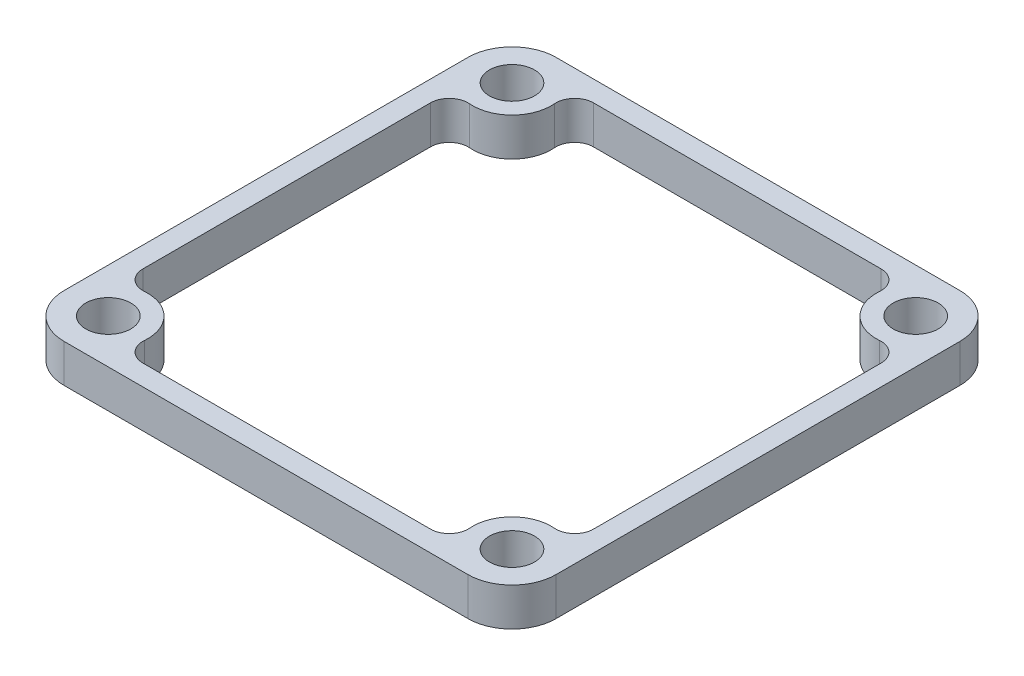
ISO-10303-21;
HEADER;
FILE_DESCRIPTION(('STEP AP214'),'2;1');
FILE_NAME('part.step','',(''),(''),'','','');
FILE_SCHEMA(('AUTOMOTIVE_DESIGN { 1 0 10303 214 1 1 1 1 }'));
ENDSEC;
DATA;
#1=APPLICATION_CONTEXT('core data for automotive mechanical design processes');
#2=APPLICATION_PROTOCOL_DEFINITION('international standard','automotive_design',2000,#1);
#3=PRODUCT_CONTEXT('',#1,'mechanical');
#4=PRODUCT('Part','Part','',(#3));
#5=PRODUCT_RELATED_PRODUCT_CATEGORY('part','',(#4));
#6=PRODUCT_DEFINITION_FORMATION('','',#4);
#7=PRODUCT_DEFINITION_CONTEXT('part definition',#1,'design');
#8=PRODUCT_DEFINITION('design','',#6,#7);
#9=PRODUCT_DEFINITION_SHAPE('','',#8);
#10=(LENGTH_UNIT() NAMED_UNIT(*) SI_UNIT(.MILLI.,.METRE.));
#11=(NAMED_UNIT(*) PLANE_ANGLE_UNIT() SI_UNIT($,.RADIAN.));
#12=(NAMED_UNIT(*) SI_UNIT($,.STERADIAN.) SOLID_ANGLE_UNIT());
#13=UNCERTAINTY_MEASURE_WITH_UNIT(LENGTH_MEASURE(1.E-05),#10,'distance_accuracy_value','');
#14=(GEOMETRIC_REPRESENTATION_CONTEXT(3) GLOBAL_UNCERTAINTY_ASSIGNED_CONTEXT((#13)) GLOBAL_UNIT_ASSIGNED_CONTEXT((#10,
#11,#12)) REPRESENTATION_CONTEXT('',''));
#15=CARTESIAN_POINT('',(0.,0.,0.));
#16=DIRECTION('',(0.,0.,1.));
#17=DIRECTION('',(1.,0.,0.));
#18=AXIS2_PLACEMENT_3D('',#15,#16,#17);
#19=CARTESIAN_POINT('',(21.75,2.032,-18.4100970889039));
#20=DIRECTION('',(0.,-1.,0.));
#21=DIRECTION('',(0.,0.,-1.));
#22=AXIS2_PLACEMENT_3D('',#19,#20,#21);
#23=CYLINDRICAL_SURFACE('',#22,1.);
#24=DIRECTION('',(0.,1.,0.));
#25=VECTOR('',#24,1.);
#26=CARTESIAN_POINT('',(22.75,2.032,-18.4100970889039));
#27=LINE('',#26,#25);
#28=CARTESIAN_POINT('',(22.75,2.032,-18.4100970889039));
#29=VERTEX_POINT('',#28);
#30=CARTESIAN_POINT('',(22.75,0.,-18.4100970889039));
#31=VERTEX_POINT('',#30);
#32=EDGE_CURVE('E423',#29,#31,#27,.F.);
#33=ORIENTED_EDGE('',*,*,#32,.F.);
#34=CARTESIAN_POINT('',(21.75,2.032,-18.4100970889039));
#35=DIRECTION('',(0.,1.,0.));
#36=DIRECTION('',(0.,0.,1.));
#37=AXIS2_PLACEMENT_3D('',#34,#35,#36);
#38=CIRCLE('',#37,1.);
#39=CARTESIAN_POINT('',(21.6693548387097,2.032,-19.406839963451));
#40=VERTEX_POINT('',#39);
#41=EDGE_CURVE('E53',#29,#40,#38,.T.);
#42=ORIENTED_EDGE('',*,*,#41,.T.);
#43=DIRECTION('',(0.,-1.,0.));
#44=VECTOR('',#43,1.);
#45=CARTESIAN_POINT('',(21.6693548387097,2.032,-19.406839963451));
#46=LINE('',#45,#44);
#47=CARTESIAN_POINT('',(21.6693548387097,0.,-19.406839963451));
#48=VERTEX_POINT('',#47);
#49=EDGE_CURVE('E427',#48,#40,#46,.F.);
#50=ORIENTED_EDGE('',*,*,#49,.F.);
#51=CARTESIAN_POINT('',(21.75,0.,-18.4100970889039));
#52=DIRECTION('',(0.,1.,0.));
#53=DIRECTION('',(0.,0.,1.));
#54=AXIS2_PLACEMENT_3D('',#51,#52,#53);
#55=CIRCLE('',#54,1.);
#56=EDGE_CURVE('E11',#48,#31,#55,.F.);
#57=ORIENTED_EDGE('',*,*,#56,.T.);
#58=EDGE_LOOP('',(#33,#42,#50,#57));
#59=FACE_BOUND('',#58,.T.);
#60=ADVANCED_FACE('F45',(#59),#23,.F.);
#61=CARTESIAN_POINT('',(21.75,2.032,-3.08990291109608));
#62=DIRECTION('',(0.,-1.,0.));
#63=DIRECTION('',(0.,0.,-1.));
#64=AXIS2_PLACEMENT_3D('',#61,#62,#63);
#65=CYLINDRICAL_SURFACE('',#64,1.);
#66=DIRECTION('',(0.,-1.,0.));
#67=VECTOR('',#66,1.);
#68=CARTESIAN_POINT('',(21.6693548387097,2.032,-2.09316003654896));
#69=LINE('',#68,#67);
#70=CARTESIAN_POINT('',(21.6693548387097,2.032,-2.09316003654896));
#71=VERTEX_POINT('',#70);
#72=CARTESIAN_POINT('',(21.6693548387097,0.,-2.09316003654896));
#73=VERTEX_POINT('',#72);
#74=EDGE_CURVE('E409',#71,#73,#69,.T.);
#75=ORIENTED_EDGE('',*,*,#74,.F.);
#76=CARTESIAN_POINT('',(21.75,2.032,-3.08990291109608));
#77=DIRECTION('',(0.,1.,0.));
#78=DIRECTION('',(0.,0.,1.));
#79=AXIS2_PLACEMENT_3D('',#76,#77,#78);
#80=CIRCLE('',#79,1.);
#81=CARTESIAN_POINT('',(22.75,2.032,-3.08990291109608));
#82=VERTEX_POINT('',#81);
#83=EDGE_CURVE('E417',#71,#82,#80,.T.);
#84=ORIENTED_EDGE('',*,*,#83,.T.);
#85=DIRECTION('',(0.,1.,0.));
#86=VECTOR('',#85,1.);
#87=CARTESIAN_POINT('',(22.75,2.032,-3.08990291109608));
#88=LINE('',#87,#86);
#89=CARTESIAN_POINT('',(22.75,0.,-3.08990291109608));
#90=VERTEX_POINT('',#89);
#91=EDGE_CURVE('E413',#90,#82,#88,.T.);
#92=ORIENTED_EDGE('',*,*,#91,.F.);
#93=CARTESIAN_POINT('',(21.75,0.,-3.08990291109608));
#94=DIRECTION('',(0.,1.,0.));
#95=DIRECTION('',(0.,0.,1.));
#96=AXIS2_PLACEMENT_3D('',#93,#94,#95);
#97=CIRCLE('',#96,1.);
#98=EDGE_CURVE('E420',#90,#73,#97,.F.);
#99=ORIENTED_EDGE('',*,*,#98,.T.);
#100=EDGE_LOOP('',(#75,#84,#92,#99));
#101=FACE_BOUND('',#100,.T.);
#102=ADVANCED_FACE('F533',(#101),#65,.F.);
#103=CARTESIAN_POINT('',(18.4100970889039,2.032,0.250000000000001));
#104=DIRECTION('',(0.,-1.,0.));
#105=DIRECTION('',(0.,0.,-1.));
#106=AXIS2_PLACEMENT_3D('',#103,#104,#105);
#107=CYLINDRICAL_SURFACE('',#106,1.);
#108=DIRECTION('',(0.,1.,0.));
#109=VECTOR('',#108,1.);
#110=CARTESIAN_POINT('',(18.4100970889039,2.032,1.25));
#111=LINE('',#110,#109);
#112=CARTESIAN_POINT('',(18.4100970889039,2.032,1.25));
#113=VERTEX_POINT('',#112);
#114=CARTESIAN_POINT('',(18.4100970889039,0.,1.25));
#115=VERTEX_POINT('',#114);
#116=EDGE_CURVE('E394',#113,#115,#111,.F.);
#117=ORIENTED_EDGE('',*,*,#116,.F.);
#118=CARTESIAN_POINT('',(18.4100970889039,2.032,0.250000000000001));
#119=DIRECTION('',(0.,1.,0.));
#120=DIRECTION('',(0.,0.,1.));
#121=AXIS2_PLACEMENT_3D('',#118,#119,#120);
#122=CIRCLE('',#121,1.);
#123=CARTESIAN_POINT('',(19.406839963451,2.032,0.169354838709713));
#124=VERTEX_POINT('',#123);
#125=EDGE_CURVE('E402',#113,#124,#122,.T.);
#126=ORIENTED_EDGE('',*,*,#125,.T.);
#127=DIRECTION('',(0.,-1.,0.));
#128=VECTOR('',#127,1.);
#129=CARTESIAN_POINT('',(19.406839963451,2.032,0.169354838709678));
#130=LINE('',#129,#128);
#131=CARTESIAN_POINT('',(19.406839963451,0.,0.169354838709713));
#132=VERTEX_POINT('',#131);
#133=EDGE_CURVE('E398',#132,#124,#130,.F.);
#134=ORIENTED_EDGE('',*,*,#133,.F.);
#135=CARTESIAN_POINT('',(18.4100970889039,0.,0.250000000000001));
#136=DIRECTION('',(0.,1.,0.));
#137=DIRECTION('',(0.,0.,1.));
#138=AXIS2_PLACEMENT_3D('',#135,#136,#137);
#139=CIRCLE('',#138,1.);
#140=EDGE_CURVE('E406',#132,#115,#139,.F.);
#141=ORIENTED_EDGE('',*,*,#140,.T.);
#142=EDGE_LOOP('',(#117,#126,#134,#141));
#143=FACE_BOUND('',#142,.T.);
#144=ADVANCED_FACE('F539',(#143),#107,.F.);
#145=CARTESIAN_POINT('',(3.08990291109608,2.032,0.250000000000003));
#146=DIRECTION('',(0.,-1.,0.));
#147=DIRECTION('',(0.,0.,-1.));
#148=AXIS2_PLACEMENT_3D('',#145,#146,#147);
#149=CYLINDRICAL_SURFACE('',#148,1.);
#150=DIRECTION('',(0.,-1.,0.));
#151=VECTOR('',#150,1.);
#152=CARTESIAN_POINT('',(2.09316003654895,2.032,0.169354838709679));
#153=LINE('',#152,#151);
#154=CARTESIAN_POINT('',(2.09316003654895,2.032,0.16935483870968));
#155=VERTEX_POINT('',#154);
#156=CARTESIAN_POINT('',(2.09316003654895,0.,0.16935483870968));
#157=VERTEX_POINT('',#156);
#158=EDGE_CURVE('E380',#155,#157,#153,.T.);
#159=ORIENTED_EDGE('',*,*,#158,.F.);
#160=CARTESIAN_POINT('',(3.08990291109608,2.032,0.250000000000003));
#161=DIRECTION('',(0.,1.,0.));
#162=DIRECTION('',(0.,0.,1.));
#163=AXIS2_PLACEMENT_3D('',#160,#161,#162);
#164=CIRCLE('',#163,1.);
#165=CARTESIAN_POINT('',(3.08990291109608,2.032,1.25));
#166=VERTEX_POINT('',#165);
#167=EDGE_CURVE('E388',#155,#166,#164,.T.);
#168=ORIENTED_EDGE('',*,*,#167,.T.);
#169=DIRECTION('',(0.,1.,0.));
#170=VECTOR('',#169,1.);
#171=CARTESIAN_POINT('',(3.08990291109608,2.032,1.25));
#172=LINE('',#171,#170);
#173=CARTESIAN_POINT('',(3.08990291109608,0.,1.25));
#174=VERTEX_POINT('',#173);
#175=EDGE_CURVE('E384',#174,#166,#172,.T.);
#176=ORIENTED_EDGE('',*,*,#175,.F.);
#177=CARTESIAN_POINT('',(3.08990291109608,0.,0.250000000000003));
#178=DIRECTION('',(0.,1.,0.));
#179=DIRECTION('',(0.,0.,1.));
#180=AXIS2_PLACEMENT_3D('',#177,#178,#179);
#181=CIRCLE('',#180,1.);
#182=EDGE_CURVE('E391',#174,#157,#181,.F.);
#183=ORIENTED_EDGE('',*,*,#182,.T.);
#184=EDGE_LOOP('',(#159,#168,#176,#183));
#185=FACE_BOUND('',#184,.T.);
#186=ADVANCED_FACE('F585',(#185),#149,.F.);
#187=CARTESIAN_POINT('',(-0.25,2.032,-3.08990291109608));
#188=DIRECTION('',(0.,-1.,0.));
#189=DIRECTION('',(0.,0.,-1.));
#190=AXIS2_PLACEMENT_3D('',#187,#188,#189);
#191=CYLINDRICAL_SURFACE('',#190,1.);
#192=DIRECTION('',(0.,1.,0.));
#193=VECTOR('',#192,1.);
#194=CARTESIAN_POINT('',(-1.25,2.032,-3.08990291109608));
#195=LINE('',#194,#193);
#196=CARTESIAN_POINT('',(-1.25,2.032,-3.08990291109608));
#197=VERTEX_POINT('',#196);
#198=CARTESIAN_POINT('',(-1.25,0.,-3.08990291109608));
#199=VERTEX_POINT('',#198);
#200=EDGE_CURVE('E365',#197,#199,#195,.F.);
#201=ORIENTED_EDGE('',*,*,#200,.F.);
#202=CARTESIAN_POINT('',(-0.25,2.032,-3.08990291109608));
#203=DIRECTION('',(0.,1.,0.));
#204=DIRECTION('',(0.,0.,1.));
#205=AXIS2_PLACEMENT_3D('',#202,#203,#204);
#206=CIRCLE('',#205,1.);
#207=CARTESIAN_POINT('',(-0.169354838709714,2.032,-2.09316003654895));
#208=VERTEX_POINT('',#207);
#209=EDGE_CURVE('E373',#197,#208,#206,.T.);
#210=ORIENTED_EDGE('',*,*,#209,.T.);
#211=DIRECTION('',(0.,-1.,0.));
#212=VECTOR('',#211,1.);
#213=CARTESIAN_POINT('',(-0.169354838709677,2.032,-2.09316003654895));
#214=LINE('',#213,#212);
#215=CARTESIAN_POINT('',(-0.169354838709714,0.,-2.09316003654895));
#216=VERTEX_POINT('',#215);
#217=EDGE_CURVE('E369',#216,#208,#214,.F.);
#218=ORIENTED_EDGE('',*,*,#217,.F.);
#219=CARTESIAN_POINT('',(-0.25,0.,-3.08990291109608));
#220=DIRECTION('',(0.,1.,0.));
#221=DIRECTION('',(0.,0.,1.));
#222=AXIS2_PLACEMENT_3D('',#219,#220,#221);
#223=CIRCLE('',#222,1.);
#224=EDGE_CURVE('E377',#216,#199,#223,.F.);
#225=ORIENTED_EDGE('',*,*,#224,.T.);
#226=EDGE_LOOP('',(#201,#210,#218,#225));
#227=FACE_BOUND('',#226,.T.);
#228=ADVANCED_FACE('F500',(#227),#191,.F.);
#229=CARTESIAN_POINT('',(-0.25,2.032,-18.4100970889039));
#230=DIRECTION('',(0.,-1.,0.));
#231=DIRECTION('',(0.,0.,-1.));
#232=AXIS2_PLACEMENT_3D('',#229,#230,#231);
#233=CYLINDRICAL_SURFACE('',#232,1.);
#234=DIRECTION('',(0.,-1.,0.));
#235=VECTOR('',#234,1.);
#236=CARTESIAN_POINT('',(-0.169354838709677,2.032,-19.406839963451));
#237=LINE('',#236,#235);
#238=CARTESIAN_POINT('',(-0.169354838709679,2.032,-19.406839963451));
#239=VERTEX_POINT('',#238);
#240=CARTESIAN_POINT('',(-0.169354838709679,0.,-19.406839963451));
#241=VERTEX_POINT('',#240);
#242=EDGE_CURVE('E351',#239,#241,#237,.T.);
#243=ORIENTED_EDGE('',*,*,#242,.F.);
#244=CARTESIAN_POINT('',(-0.25,2.032,-18.4100970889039));
#245=DIRECTION('',(0.,1.,0.));
#246=DIRECTION('',(0.,0.,1.));
#247=AXIS2_PLACEMENT_3D('',#244,#245,#246);
#248=CIRCLE('',#247,1.);
#249=CARTESIAN_POINT('',(-1.25,2.032,-18.4100970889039));
#250=VERTEX_POINT('',#249);
#251=EDGE_CURVE('E359',#239,#250,#248,.T.);
#252=ORIENTED_EDGE('',*,*,#251,.T.);
#253=DIRECTION('',(0.,1.,0.));
#254=VECTOR('',#253,1.);
#255=CARTESIAN_POINT('',(-1.25,2.032,-18.4100970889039));
#256=LINE('',#255,#254);
#257=CARTESIAN_POINT('',(-1.25,0.,-18.4100970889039));
#258=VERTEX_POINT('',#257);
#259=EDGE_CURVE('E355',#258,#250,#256,.T.);
#260=ORIENTED_EDGE('',*,*,#259,.F.);
#261=CARTESIAN_POINT('',(-0.25,0.,-18.4100970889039));
#262=DIRECTION('',(0.,1.,0.));
#263=DIRECTION('',(0.,0.,1.));
#264=AXIS2_PLACEMENT_3D('',#261,#262,#263);
#265=CIRCLE('',#264,1.);
#266=EDGE_CURVE('E362',#258,#241,#265,.F.);
#267=ORIENTED_EDGE('',*,*,#266,.T.);
#268=EDGE_LOOP('',(#243,#252,#260,#267));
#269=FACE_BOUND('',#268,.T.);
#270=ADVANCED_FACE('F507',(#269),#233,.F.);
#271=CARTESIAN_POINT('',(3.08990291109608,2.032,-21.75));
#272=DIRECTION('',(0.,-1.,0.));
#273=DIRECTION('',(0.,0.,-1.));
#274=AXIS2_PLACEMENT_3D('',#271,#272,#273);
#275=CYLINDRICAL_SURFACE('',#274,1.);
#276=DIRECTION('',(0.,1.,0.));
#277=VECTOR('',#276,1.);
#278=CARTESIAN_POINT('',(3.08990291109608,2.032,-22.75));
#279=LINE('',#278,#277);
#280=CARTESIAN_POINT('',(3.08990291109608,2.032,-22.75));
#281=VERTEX_POINT('',#280);
#282=CARTESIAN_POINT('',(3.08990291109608,0.,-22.75));
#283=VERTEX_POINT('',#282);
#284=EDGE_CURVE('E336',#281,#283,#279,.F.);
#285=ORIENTED_EDGE('',*,*,#284,.F.);
#286=CARTESIAN_POINT('',(3.08990291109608,2.032,-21.75));
#287=DIRECTION('',(0.,1.,0.));
#288=DIRECTION('',(0.,0.,1.));
#289=AXIS2_PLACEMENT_3D('',#286,#287,#288);
#290=CIRCLE('',#289,1.);
#291=CARTESIAN_POINT('',(2.09316003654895,2.032,-21.6693548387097));
#292=VERTEX_POINT('',#291);
#293=EDGE_CURVE('E344',#281,#292,#290,.T.);
#294=ORIENTED_EDGE('',*,*,#293,.T.);
#295=DIRECTION('',(0.,-1.,0.));
#296=VECTOR('',#295,1.);
#297=CARTESIAN_POINT('',(2.09316003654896,2.032,-21.6693548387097));
#298=LINE('',#297,#296);
#299=CARTESIAN_POINT('',(2.09316003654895,0.,-21.6693548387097));
#300=VERTEX_POINT('',#299);
#301=EDGE_CURVE('E340',#300,#292,#298,.F.);
#302=ORIENTED_EDGE('',*,*,#301,.F.);
#303=CARTESIAN_POINT('',(3.08990291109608,0.,-21.75));
#304=DIRECTION('',(0.,1.,0.));
#305=DIRECTION('',(0.,0.,1.));
#306=AXIS2_PLACEMENT_3D('',#303,#304,#305);
#307=CIRCLE('',#306,1.);
#308=EDGE_CURVE('E348',#300,#283,#307,.F.);
#309=ORIENTED_EDGE('',*,*,#308,.T.);
#310=EDGE_LOOP('',(#285,#294,#302,#309));
#311=FACE_BOUND('',#310,.T.);
#312=ADVANCED_FACE('F514',(#311),#275,.F.);
#313=CARTESIAN_POINT('',(18.4100970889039,2.032,-21.75));
#314=DIRECTION('',(0.,-1.,0.));
#315=DIRECTION('',(0.,0.,-1.));
#316=AXIS2_PLACEMENT_3D('',#313,#314,#315);
#317=CYLINDRICAL_SURFACE('',#316,1.);
#318=DIRECTION('',(0.,1.,0.));
#319=VECTOR('',#318,1.);
#320=CARTESIAN_POINT('',(18.4100970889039,2.032,-22.75));
#321=LINE('',#320,#319);
#322=CARTESIAN_POINT('',(18.4100970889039,0.,-22.75));
#323=VERTEX_POINT('',#322);
#324=CARTESIAN_POINT('',(18.4100970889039,2.032,-22.75));
#325=VERTEX_POINT('',#324);
#326=EDGE_CURVE('E320',#323,#325,#321,.T.);
#327=ORIENTED_EDGE('',*,*,#326,.F.);
#328=CARTESIAN_POINT('',(18.4100970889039,0.,-21.75));
#329=DIRECTION('',(0.,1.,0.));
#330=DIRECTION('',(0.,0.,1.));
#331=AXIS2_PLACEMENT_3D('',#328,#329,#330);
#332=CIRCLE('',#331,1.);
#333=CARTESIAN_POINT('',(19.406839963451,0.,-21.6693548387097));
#334=VERTEX_POINT('',#333);
#335=EDGE_CURVE('E330',#323,#334,#332,.F.);
#336=ORIENTED_EDGE('',*,*,#335,.T.);
#337=DIRECTION('',(0.,-1.,0.));
#338=VECTOR('',#337,1.);
#339=CARTESIAN_POINT('',(19.406839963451,2.032,-21.6693548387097));
#340=LINE('',#339,#338);
#341=CARTESIAN_POINT('',(19.406839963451,2.032,-21.6693548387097));
#342=VERTEX_POINT('',#341);
#343=EDGE_CURVE('E326',#342,#334,#340,.T.);
#344=ORIENTED_EDGE('',*,*,#343,.F.);
#345=CARTESIAN_POINT('',(18.4100970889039,2.032,-21.75));
#346=DIRECTION('',(0.,1.,0.));
#347=DIRECTION('',(0.,0.,1.));
#348=AXIS2_PLACEMENT_3D('',#345,#346,#347);
#349=CIRCLE('',#348,1.);
#350=EDGE_CURVE('E333',#342,#325,#349,.T.);
#351=ORIENTED_EDGE('',*,*,#350,.T.);
#352=EDGE_LOOP('',(#327,#336,#344,#351));
#353=FACE_BOUND('',#352,.T.);
#354=ADVANCED_FACE('F519',(#353),#317,.F.);
#355=CARTESIAN_POINT('',(21.5,0.,1.25));
#356=DIRECTION('',(0.,0.,1.));
#357=DIRECTION('',(1.,0.,0.));
#358=AXIS2_PLACEMENT_3D('',#355,#356,#357);
#359=PLANE('',#358);
#360=DIRECTION('',(1.,0.,0.));
#361=VECTOR('',#360,1.);
#362=CARTESIAN_POINT('',(21.5,2.032,1.25));
#363=LINE('',#362,#361);
#364=EDGE_CURVE('E459',#166,#113,#363,.T.);
#365=ORIENTED_EDGE('',*,*,#364,.T.);
#366=ORIENTED_EDGE('',*,*,#116,.T.);
#367=DIRECTION('',(1.,0.,0.));
#368=VECTOR('',#367,1.);
#369=CARTESIAN_POINT('',(21.5,0.,1.25));
#370=LINE('',#369,#368);
#371=EDGE_CURVE('E463',#174,#115,#370,.T.);
#372=ORIENTED_EDGE('',*,*,#371,.F.);
#373=ORIENTED_EDGE('',*,*,#175,.T.);
#374=EDGE_LOOP('',(#365,#366,#372,#373));
#375=FACE_BOUND('',#374,.T.);
#376=ADVANCED_FACE('F521',(#375),#359,.F.);
#377=CARTESIAN_POINT('',(-1.25,0.,0.));
#378=DIRECTION('',(-1.,0.,0.));
#379=DIRECTION('',(0.,0.,1.));
#380=AXIS2_PLACEMENT_3D('',#377,#378,#379);
#381=PLANE('',#380);
#382=DIRECTION('',(0.,0.,1.));
#383=VECTOR('',#382,1.);
#384=CARTESIAN_POINT('',(-1.25,2.032,0.));
#385=LINE('',#384,#383);
#386=EDGE_CURVE('E241',#250,#197,#385,.T.);
#387=ORIENTED_EDGE('',*,*,#386,.T.);
#388=ORIENTED_EDGE('',*,*,#200,.T.);
#389=DIRECTION('',(0.,0.,1.));
#390=VECTOR('',#389,1.);
#391=CARTESIAN_POINT('',(-1.25,0.,0.));
#392=LINE('',#391,#390);
#393=EDGE_CURVE('E267',#258,#199,#392,.T.);
#394=ORIENTED_EDGE('',*,*,#393,.F.);
#395=ORIENTED_EDGE('',*,*,#259,.T.);
#396=EDGE_LOOP('',(#387,#388,#394,#395));
#397=FACE_BOUND('',#396,.T.);
#398=ADVANCED_FACE('F491',(#397),#381,.F.);
#399=CARTESIAN_POINT('',(22.75,0.,-21.5));
#400=DIRECTION('',(1.,0.,0.));
#401=DIRECTION('',(0.,0.,-1.));
#402=AXIS2_PLACEMENT_3D('',#399,#400,#401);
#403=PLANE('',#402);
#404=DIRECTION('',(0.,0.,-1.));
#405=VECTOR('',#404,1.);
#406=CARTESIAN_POINT('',(22.75,2.032,-21.5));
#407=LINE('',#406,#405);
#408=EDGE_CURVE('E480',#82,#29,#407,.T.);
#409=ORIENTED_EDGE('',*,*,#408,.T.);
#410=ORIENTED_EDGE('',*,*,#32,.T.);
#411=DIRECTION('',(0.,0.,-1.));
#412=VECTOR('',#411,1.);
#413=CARTESIAN_POINT('',(22.75,0.,-21.5));
#414=LINE('',#413,#412);
#415=EDGE_CURVE('E467',#90,#31,#414,.T.);
#416=ORIENTED_EDGE('',*,*,#415,.F.);
#417=ORIENTED_EDGE('',*,*,#91,.T.);
#418=EDGE_LOOP('',(#409,#410,#416,#417));
#419=FACE_BOUND('',#418,.T.);
#420=ADVANCED_FACE('F543',(#419),#403,.F.);
#421=CARTESIAN_POINT('',(0.,0.,-22.75));
#422=DIRECTION('',(0.,0.,-1.));
#423=DIRECTION('',(-1.,0.,0.));
#424=AXIS2_PLACEMENT_3D('',#421,#422,#423);
#425=PLANE('',#424);
#426=DIRECTION('',(-1.,0.,0.));
#427=VECTOR('',#426,1.);
#428=CARTESIAN_POINT('',(0.,2.032,-22.75));
#429=LINE('',#428,#427);
#430=EDGE_CURVE('E483',#325,#281,#429,.T.);
#431=ORIENTED_EDGE('',*,*,#430,.T.);
#432=ORIENTED_EDGE('',*,*,#284,.T.);
#433=DIRECTION('',(-1.,0.,0.));
#434=VECTOR('',#433,1.);
#435=CARTESIAN_POINT('',(0.,0.,-22.75));
#436=LINE('',#435,#434);
#437=EDGE_CURVE('E470',#323,#283,#436,.T.);
#438=ORIENTED_EDGE('',*,*,#437,.F.);
#439=ORIENTED_EDGE('',*,*,#326,.T.);
#440=EDGE_LOOP('',(#431,#432,#438,#439));
#441=FACE_BOUND('',#440,.T.);
#442=ADVANCED_FACE('F516',(#441),#425,.F.);
#443=CARTESIAN_POINT('',(0.,2.032,-21.5));
#444=DIRECTION('',(0.,-1.,0.));
#445=DIRECTION('',(0.,0.,-1.));
#446=AXIS2_PLACEMENT_3D('',#443,#444,#445);
#447=CYLINDRICAL_SURFACE('',#446,2.1);
#448=CARTESIAN_POINT('',(0.,2.032,-21.5));
#449=DIRECTION('',(0.,1.,0.));
#450=DIRECTION('',(0.,0.,1.));
#451=AXIS2_PLACEMENT_3D('',#448,#449,#450);
#452=CIRCLE('',#451,2.1);
#453=EDGE_CURVE('E317',#239,#292,#452,.T.);
#454=ORIENTED_EDGE('',*,*,#453,.F.);
#455=ORIENTED_EDGE('',*,*,#242,.T.);
#456=CARTESIAN_POINT('',(0.,0.,-21.5));
#457=DIRECTION('',(0.,1.,0.));
#458=DIRECTION('',(0.,0.,1.));
#459=AXIS2_PLACEMENT_3D('',#456,#457,#458);
#460=CIRCLE('',#459,2.1);
#461=EDGE_CURVE('E313',#241,#300,#460,.T.);
#462=ORIENTED_EDGE('',*,*,#461,.T.);
#463=ORIENTED_EDGE('',*,*,#301,.T.);
#464=EDGE_LOOP('',(#454,#455,#462,#463));
#465=FACE_BOUND('',#464,.T.);
#466=ADVANCED_FACE('F510',(#465),#447,.T.);
#467=CARTESIAN_POINT('',(0.,2.032,-21.5));
#468=DIRECTION('',(0.,1.,0.));
#469=DIRECTION('',(0.,0.,1.));
#470=AXIS2_PLACEMENT_3D('',#467,#468,#469);
#471=PLANE('',#470);
#472=ORIENTED_EDGE('',*,*,#83,.F.);
#473=CARTESIAN_POINT('',(21.5,2.032,0.));
#474=DIRECTION('',(0.,1.,0.));
#475=DIRECTION('',(0.,0.,1.));
#476=AXIS2_PLACEMENT_3D('',#473,#474,#475);
#477=CIRCLE('',#476,2.1);
#478=EDGE_CURVE('E547',#71,#124,#477,.T.);
#479=ORIENTED_EDGE('',*,*,#478,.T.);
#480=ORIENTED_EDGE('',*,*,#125,.F.);
#481=ORIENTED_EDGE('',*,*,#364,.F.);
#482=ORIENTED_EDGE('',*,*,#167,.F.);
#483=CARTESIAN_POINT('',(0.,2.032,0.));
#484=DIRECTION('',(0.,1.,0.));
#485=DIRECTION('',(0.,0.,1.));
#486=AXIS2_PLACEMENT_3D('',#483,#484,#485);
#487=CIRCLE('',#486,2.1);
#488=EDGE_CURVE('E497',#155,#208,#487,.T.);
#489=ORIENTED_EDGE('',*,*,#488,.T.);
#490=ORIENTED_EDGE('',*,*,#209,.F.);
#491=ORIENTED_EDGE('',*,*,#386,.F.);
#492=ORIENTED_EDGE('',*,*,#251,.F.);
#493=ORIENTED_EDGE('',*,*,#453,.T.);
#494=ORIENTED_EDGE('',*,*,#293,.F.);
#495=ORIENTED_EDGE('',*,*,#430,.F.);
#496=ORIENTED_EDGE('',*,*,#350,.F.);
#497=CARTESIAN_POINT('',(21.5,2.032,-21.5));
#498=DIRECTION('',(0.,1.,0.));
#499=DIRECTION('',(0.,0.,1.));
#500=AXIS2_PLACEMENT_3D('',#497,#498,#499);
#501=CIRCLE('',#500,2.1);
#502=EDGE_CURVE('E435',#342,#40,#501,.T.);
#503=ORIENTED_EDGE('',*,*,#502,.T.);
#504=ORIENTED_EDGE('',*,*,#41,.F.);
#505=ORIENTED_EDGE('',*,*,#408,.F.);
#506=EDGE_LOOP('',(#472,#479,#480,#481,#482,#489,#490,#491,#492,#493,#494,#495,#496,#503,#504,#505));
#507=FACE_BOUND('',#506,.T.);
#508=CARTESIAN_POINT('',(0.,2.032,0.));
#509=DIRECTION('',(0.,1.,0.));
#510=DIRECTION('',(0.,0.,-1.));
#511=AXIS2_PLACEMENT_3D('',#508,#509,#510);
#512=CIRCLE('',#511,2.35);
#513=CARTESIAN_POINT('',(-2.35,2.032,0.));
#514=VERTEX_POINT('',#513);
#515=CARTESIAN_POINT('',(0.,2.032,2.35));
#516=VERTEX_POINT('',#515);
#517=EDGE_CURVE('E264',#514,#516,#512,.T.);
#518=ORIENTED_EDGE('',*,*,#517,.T.);
#519=DIRECTION('',(1.,0.,0.));
#520=VECTOR('',#519,1.);
#521=CARTESIAN_POINT('',(21.5,2.032,2.35));
#522=LINE('',#521,#520);
#523=CARTESIAN_POINT('',(21.5,2.032,2.35));
#524=VERTEX_POINT('',#523);
#525=EDGE_CURVE('E209',#516,#524,#522,.T.);
#526=ORIENTED_EDGE('',*,*,#525,.T.);
#527=CARTESIAN_POINT('',(21.5,2.032,0.));
#528=DIRECTION('',(0.,1.,0.));
#529=DIRECTION('',(0.,0.,-1.));
#530=AXIS2_PLACEMENT_3D('',#527,#528,#529);
#531=CIRCLE('',#530,2.35);
#532=CARTESIAN_POINT('',(23.85,2.032,0.));
#533=VERTEX_POINT('',#532);
#534=EDGE_CURVE('E270',#524,#533,#531,.T.);
#535=ORIENTED_EDGE('',*,*,#534,.T.);
#536=DIRECTION('',(0.,0.,-1.));
#537=VECTOR('',#536,1.);
#538=CARTESIAN_POINT('',(23.85,2.032,-21.5));
#539=LINE('',#538,#537);
#540=CARTESIAN_POINT('',(23.85,2.032,-21.5));
#541=VERTEX_POINT('',#540);
#542=EDGE_CURVE('E274',#533,#541,#539,.T.);
#543=ORIENTED_EDGE('',*,*,#542,.T.);
#544=CARTESIAN_POINT('',(21.5,2.032,-21.5));
#545=DIRECTION('',(0.,1.,0.));
#546=DIRECTION('',(0.,0.,-1.));
#547=AXIS2_PLACEMENT_3D('',#544,#545,#546);
#548=CIRCLE('',#547,2.35);
#549=CARTESIAN_POINT('',(21.5,2.032,-23.85));
#550=VERTEX_POINT('',#549);
#551=EDGE_CURVE('E278',#541,#550,#548,.T.);
#552=ORIENTED_EDGE('',*,*,#551,.T.);
#553=DIRECTION('',(-1.,0.,0.));
#554=VECTOR('',#553,1.);
#555=CARTESIAN_POINT('',(0.,2.032,-23.85));
#556=LINE('',#555,#554);
#557=CARTESIAN_POINT('',(0.,2.032,-23.85));
#558=VERTEX_POINT('',#557);
#559=EDGE_CURVE('E282',#550,#558,#556,.T.);
#560=ORIENTED_EDGE('',*,*,#559,.T.);
#561=CARTESIAN_POINT('',(0.,2.032,-21.5));
#562=DIRECTION('',(0.,1.,0.));
#563=DIRECTION('',(0.,0.,-1.));
#564=AXIS2_PLACEMENT_3D('',#561,#562,#563);
#565=CIRCLE('',#564,2.35);
#566=CARTESIAN_POINT('',(-2.35,2.032,-21.5));
#567=VERTEX_POINT('',#566);
#568=EDGE_CURVE('E238',#558,#567,#565,.T.);
#569=ORIENTED_EDGE('',*,*,#568,.T.);
#570=DIRECTION('',(0.,0.,1.));
#571=VECTOR('',#570,1.);
#572=CARTESIAN_POINT('',(-2.35,2.032,0.));
#573=LINE('',#572,#571);
#574=EDGE_CURVE('E234',#567,#514,#573,.T.);
#575=ORIENTED_EDGE('',*,*,#574,.T.);
#576=EDGE_LOOP('',(#518,#526,#535,#543,#552,#560,#569,#575));
#577=FACE_BOUND('',#576,.T.);
#578=CARTESIAN_POINT('',(0.,2.032,-21.5));
#579=DIRECTION('',(0.,1.,0.));
#580=DIRECTION('',(0.,0.,1.));
#581=AXIS2_PLACEMENT_3D('',#578,#579,#580);
#582=CIRCLE('',#581,1.2);
#583=CARTESIAN_POINT('',(0.,2.032,-20.3));
#584=VERTEX_POINT('',#583);
#585=EDGE_CURVE('E309',#584,#584,#582,.T.);
#586=ORIENTED_EDGE('',*,*,#585,.F.);
#587=EDGE_LOOP('',(#586));
#588=FACE_BOUND('',#587,.T.);
#589=CARTESIAN_POINT('',(21.5,2.032,-21.5));
#590=DIRECTION('',(0.,1.,0.));
#591=DIRECTION('',(0.,0.,1.));
#592=AXIS2_PLACEMENT_3D('',#589,#590,#591);
#593=CIRCLE('',#592,1.2);
#594=CARTESIAN_POINT('',(21.5,2.032,-20.3));
#595=VERTEX_POINT('',#594);
#596=EDGE_CURVE('E448',#595,#595,#593,.T.);
#597=ORIENTED_EDGE('',*,*,#596,.F.);
#598=EDGE_LOOP('',(#597));
#599=FACE_BOUND('',#598,.T.);
#600=CARTESIAN_POINT('',(21.5,2.032,0.));
#601=DIRECTION('',(0.,1.,0.));
#602=DIRECTION('',(0.,0.,1.));
#603=AXIS2_PLACEMENT_3D('',#600,#601,#602);
#604=CIRCLE('',#603,1.2);
#605=CARTESIAN_POINT('',(21.5,2.032,1.2));
#606=VERTEX_POINT('',#605);
#607=EDGE_CURVE('E451',#606,#606,#604,.T.);
#608=ORIENTED_EDGE('',*,*,#607,.F.);
#609=EDGE_LOOP('',(#608));
#610=FACE_BOUND('',#609,.T.);
#611=CARTESIAN_POINT('',(0.,2.032,0.));
#612=DIRECTION('',(0.,1.,0.));
#613=DIRECTION('',(0.,0.,1.));
#614=AXIS2_PLACEMENT_3D('',#611,#612,#613);
#615=CIRCLE('',#614,1.2);
#616=CARTESIAN_POINT('',(0.,2.032,1.2));
#617=VERTEX_POINT('',#616);
#618=EDGE_CURVE('E560',#617,#617,#615,.T.);
#619=ORIENTED_EDGE('',*,*,#618,.F.);
#620=EDGE_LOOP('',(#619));
#621=FACE_BOUND('',#620,.T.);
#622=ADVANCED_FACE('F438',(#507,#577,#588,#599,#610,#621),#471,.T.);
#623=CARTESIAN_POINT('',(0.,0.,-21.5));
#624=DIRECTION('',(0.,1.,0.));
#625=DIRECTION('',(0.,0.,1.));
#626=AXIS2_PLACEMENT_3D('',#623,#624,#625);
#627=PLANE('',#626);
#628=ORIENTED_EDGE('',*,*,#98,.F.);
#629=ORIENTED_EDGE('',*,*,#415,.T.);
#630=ORIENTED_EDGE('',*,*,#56,.F.);
#631=CARTESIAN_POINT('',(21.5,0.,-21.5));
#632=DIRECTION('',(0.,1.,0.));
#633=DIRECTION('',(0.,0.,1.));
#634=AXIS2_PLACEMENT_3D('',#631,#632,#633);
#635=CIRCLE('',#634,2.1);
#636=EDGE_CURVE('E436',#334,#48,#635,.T.);
#637=ORIENTED_EDGE('',*,*,#636,.F.);
#638=ORIENTED_EDGE('',*,*,#335,.F.);
#639=ORIENTED_EDGE('',*,*,#437,.T.);
#640=ORIENTED_EDGE('',*,*,#308,.F.);
#641=ORIENTED_EDGE('',*,*,#461,.F.);
#642=ORIENTED_EDGE('',*,*,#266,.F.);
#643=ORIENTED_EDGE('',*,*,#393,.T.);
#644=ORIENTED_EDGE('',*,*,#224,.F.);
#645=CARTESIAN_POINT('',(0.,0.,0.));
#646=DIRECTION('',(0.,1.,0.));
#647=DIRECTION('',(0.,0.,1.));
#648=AXIS2_PLACEMENT_3D('',#645,#646,#647);
#649=CIRCLE('',#648,2.1);
#650=EDGE_CURVE('E503',#157,#216,#649,.T.);
#651=ORIENTED_EDGE('',*,*,#650,.F.);
#652=ORIENTED_EDGE('',*,*,#182,.F.);
#653=ORIENTED_EDGE('',*,*,#371,.T.);
#654=ORIENTED_EDGE('',*,*,#140,.F.);
#655=CARTESIAN_POINT('',(21.5,0.,0.));
#656=DIRECTION('',(0.,1.,0.));
#657=DIRECTION('',(0.,0.,1.));
#658=AXIS2_PLACEMENT_3D('',#655,#656,#657);
#659=CIRCLE('',#658,2.1);
#660=EDGE_CURVE('E553',#73,#132,#659,.T.);
#661=ORIENTED_EDGE('',*,*,#660,.F.);
#662=EDGE_LOOP('',(#628,#629,#630,#637,#638,#639,#640,#641,#642,#643,#644,#651,#652,#653,#654,#661));
#663=FACE_BOUND('',#662,.T.);
#664=CARTESIAN_POINT('',(0.,0.,0.));
#665=DIRECTION('',(0.,1.,0.));
#666=DIRECTION('',(0.,0.,-1.));
#667=AXIS2_PLACEMENT_3D('',#664,#665,#666);
#668=CIRCLE('',#667,2.35);
#669=CARTESIAN_POINT('',(-2.35,0.,0.));
#670=VERTEX_POINT('',#669);
#671=CARTESIAN_POINT('',(0.,0.,2.35));
#672=VERTEX_POINT('',#671);
#673=EDGE_CURVE('E224',#670,#672,#668,.T.);
#674=ORIENTED_EDGE('',*,*,#673,.F.);
#675=DIRECTION('',(0.,0.,1.));
#676=VECTOR('',#675,1.);
#677=CARTESIAN_POINT('',(-2.35,0.,0.));
#678=LINE('',#677,#676);
#679=CARTESIAN_POINT('',(-2.35,0.,-21.5));
#680=VERTEX_POINT('',#679);
#681=EDGE_CURVE('E216',#680,#670,#678,.T.);
#682=ORIENTED_EDGE('',*,*,#681,.F.);
#683=CARTESIAN_POINT('',(0.,0.,-21.5));
#684=DIRECTION('',(0.,1.,0.));
#685=DIRECTION('',(0.,0.,-1.));
#686=AXIS2_PLACEMENT_3D('',#683,#684,#685);
#687=CIRCLE('',#686,2.35);
#688=CARTESIAN_POINT('',(0.,0.,-23.85));
#689=VERTEX_POINT('',#688);
#690=EDGE_CURVE('E258',#689,#680,#687,.T.);
#691=ORIENTED_EDGE('',*,*,#690,.F.);
#692=DIRECTION('',(-1.,0.,0.));
#693=VECTOR('',#692,1.);
#694=CARTESIAN_POINT('',(0.,0.,-23.85));
#695=LINE('',#694,#693);
#696=CARTESIAN_POINT('',(21.5,0.,-23.85));
#697=VERTEX_POINT('',#696);
#698=EDGE_CURVE('E254',#697,#689,#695,.T.);
#699=ORIENTED_EDGE('',*,*,#698,.F.);
#700=CARTESIAN_POINT('',(21.5,0.,-21.5));
#701=DIRECTION('',(0.,1.,0.));
#702=DIRECTION('',(0.,0.,-1.));
#703=AXIS2_PLACEMENT_3D('',#700,#701,#702);
#704=CIRCLE('',#703,2.35);
#705=CARTESIAN_POINT('',(23.85,0.,-21.5));
#706=VERTEX_POINT('',#705);
#707=EDGE_CURVE('E250',#706,#697,#704,.T.);
#708=ORIENTED_EDGE('',*,*,#707,.F.);
#709=DIRECTION('',(0.,0.,-1.));
#710=VECTOR('',#709,1.);
#711=CARTESIAN_POINT('',(23.85,0.,-21.5));
#712=LINE('',#711,#710);
#713=CARTESIAN_POINT('',(23.85,0.,0.));
#714=VERTEX_POINT('',#713);
#715=EDGE_CURVE('E246',#714,#706,#712,.T.);
#716=ORIENTED_EDGE('',*,*,#715,.F.);
#717=CARTESIAN_POINT('',(21.5,0.,0.));
#718=DIRECTION('',(0.,1.,0.));
#719=DIRECTION('',(0.,0.,-1.));
#720=AXIS2_PLACEMENT_3D('',#717,#718,#719);
#721=CIRCLE('',#720,2.35);
#722=CARTESIAN_POINT('',(21.5,0.,2.35));
#723=VERTEX_POINT('',#722);
#724=EDGE_CURVE('E228',#723,#714,#721,.T.);
#725=ORIENTED_EDGE('',*,*,#724,.F.);
#726=DIRECTION('',(1.,0.,0.));
#727=VECTOR('',#726,1.);
#728=CARTESIAN_POINT('',(21.5,0.,2.35));
#729=LINE('',#728,#727);
#730=EDGE_CURVE('E207',#672,#723,#729,.T.);
#731=ORIENTED_EDGE('',*,*,#730,.F.);
#732=EDGE_LOOP('',(#674,#682,#691,#699,#708,#716,#725,#731));
#733=FACE_BOUND('',#732,.T.);
#734=CARTESIAN_POINT('',(0.,0.,-21.5));
#735=DIRECTION('',(0.,1.,0.));
#736=DIRECTION('',(0.,0.,1.));
#737=AXIS2_PLACEMENT_3D('',#734,#735,#736);
#738=CIRCLE('',#737,1.2);
#739=CARTESIAN_POINT('',(0.,0.,-20.3));
#740=VERTEX_POINT('',#739);
#741=EDGE_CURVE('E291',#740,#740,#738,.T.);
#742=ORIENTED_EDGE('',*,*,#741,.T.);
#743=EDGE_LOOP('',(#742));
#744=FACE_BOUND('',#743,.T.);
#745=CARTESIAN_POINT('',(21.5,0.,-21.5));
#746=DIRECTION('',(0.,1.,0.));
#747=DIRECTION('',(0.,0.,1.));
#748=AXIS2_PLACEMENT_3D('',#745,#746,#747);
#749=CIRCLE('',#748,1.2);
#750=CARTESIAN_POINT('',(21.5,0.,-20.3));
#751=VERTEX_POINT('',#750);
#752=EDGE_CURVE('E455',#751,#751,#749,.T.);
#753=ORIENTED_EDGE('',*,*,#752,.T.);
#754=EDGE_LOOP('',(#753));
#755=FACE_BOUND('',#754,.T.);
#756=CARTESIAN_POINT('',(21.5,0.,0.));
#757=DIRECTION('',(0.,1.,0.));
#758=DIRECTION('',(0.,0.,1.));
#759=AXIS2_PLACEMENT_3D('',#756,#757,#758);
#760=CIRCLE('',#759,1.2);
#761=CARTESIAN_POINT('',(21.5,0.,1.2));
#762=VERTEX_POINT('',#761);
#763=EDGE_CURVE('E444',#762,#762,#760,.T.);
#764=ORIENTED_EDGE('',*,*,#763,.T.);
#765=EDGE_LOOP('',(#764));
#766=FACE_BOUND('',#765,.T.);
#767=CARTESIAN_POINT('',(0.,0.,0.));
#768=DIRECTION('',(0.,1.,0.));
#769=DIRECTION('',(0.,0.,1.));
#770=AXIS2_PLACEMENT_3D('',#767,#768,#769);
#771=CIRCLE('',#770,1.2);
#772=CARTESIAN_POINT('',(0.,0.,1.2));
#773=VERTEX_POINT('',#772);
#774=EDGE_CURVE('E554',#773,#773,#771,.T.);
#775=ORIENTED_EDGE('',*,*,#774,.T.);
#776=EDGE_LOOP('',(#775));
#777=FACE_BOUND('',#776,.T.);
#778=ADVANCED_FACE('F221',(#663,#733,#744,#755,#766,#777),#627,.F.);
#779=CARTESIAN_POINT('',(0.,2.032,-21.5));
#780=DIRECTION('',(0.,-1.,0.));
#781=DIRECTION('',(0.,0.,-1.));
#782=AXIS2_PLACEMENT_3D('',#779,#780,#781);
#783=CYLINDRICAL_SURFACE('',#782,1.2);
#784=ORIENTED_EDGE('',*,*,#585,.T.);
#785=EDGE_LOOP('',(#784));
#786=FACE_BOUND('',#785,.T.);
#787=ORIENTED_EDGE('',*,*,#741,.F.);
#788=EDGE_LOOP('',(#787));
#789=FACE_BOUND('',#788,.T.);
#790=ADVANCED_FACE('F665',(#786,#789),#783,.F.);
#791=CARTESIAN_POINT('',(0.,0.,0.));
#792=DIRECTION('',(0.,1.,0.));
#793=DIRECTION('',(0.,0.,1.));
#794=AXIS2_PLACEMENT_3D('',#791,#792,#793);
#795=CYLINDRICAL_SURFACE('',#794,2.35);
#796=ORIENTED_EDGE('',*,*,#517,.F.);
#797=DIRECTION('',(0.,1.,0.));
#798=VECTOR('',#797,1.);
#799=CARTESIAN_POINT('',(-2.35,0.,0.));
#800=LINE('',#799,#798);
#801=EDGE_CURVE('E232',#670,#514,#800,.T.);
#802=ORIENTED_EDGE('',*,*,#801,.F.);
#803=ORIENTED_EDGE('',*,*,#673,.T.);
#804=DIRECTION('',(0.,1.,0.));
#805=VECTOR('',#804,1.);
#806=CARTESIAN_POINT('',(0.,0.,2.35));
#807=LINE('',#806,#805);
#808=EDGE_CURVE('E204',#672,#516,#807,.T.);
#809=ORIENTED_EDGE('',*,*,#808,.T.);
#810=EDGE_LOOP('',(#796,#802,#803,#809));
#811=FACE_BOUND('',#810,.T.);
#812=ADVANCED_FACE('F231',(#811),#795,.T.);
#813=CARTESIAN_POINT('',(-2.35,0.,0.));
#814=DIRECTION('',(-1.,0.,0.));
#815=DIRECTION('',(0.,0.,1.));
#816=AXIS2_PLACEMENT_3D('',#813,#814,#815);
#817=PLANE('',#816);
#818=ORIENTED_EDGE('',*,*,#574,.F.);
#819=DIRECTION('',(0.,1.,0.));
#820=VECTOR('',#819,1.);
#821=CARTESIAN_POINT('',(-2.35,0.,-21.5));
#822=LINE('',#821,#820);
#823=EDGE_CURVE('E292',#680,#567,#822,.T.);
#824=ORIENTED_EDGE('',*,*,#823,.F.);
#825=ORIENTED_EDGE('',*,*,#681,.T.);
#826=ORIENTED_EDGE('',*,*,#801,.T.);
#827=EDGE_LOOP('',(#818,#824,#825,#826));
#828=FACE_BOUND('',#827,.T.);
#829=ADVANCED_FACE('F763',(#828),#817,.T.);
#830=CARTESIAN_POINT('',(0.,0.,-21.5));
#831=DIRECTION('',(0.,1.,0.));
#832=DIRECTION('',(0.,0.,1.));
#833=AXIS2_PLACEMENT_3D('',#830,#831,#832);
#834=CYLINDRICAL_SURFACE('',#833,2.35);
#835=ORIENTED_EDGE('',*,*,#568,.F.);
#836=DIRECTION('',(0.,1.,0.));
#837=VECTOR('',#836,1.);
#838=CARTESIAN_POINT('',(0.,0.,-23.85));
#839=LINE('',#838,#837);
#840=EDGE_CURVE('E295',#689,#558,#839,.T.);
#841=ORIENTED_EDGE('',*,*,#840,.F.);
#842=ORIENTED_EDGE('',*,*,#690,.T.);
#843=ORIENTED_EDGE('',*,*,#823,.T.);
#844=EDGE_LOOP('',(#835,#841,#842,#843));
#845=FACE_BOUND('',#844,.T.);
#846=ADVANCED_FACE('F754',(#845),#834,.T.);
#847=CARTESIAN_POINT('',(0.,0.,-23.85));
#848=DIRECTION('',(0.,0.,-1.));
#849=DIRECTION('',(-1.,0.,0.));
#850=AXIS2_PLACEMENT_3D('',#847,#848,#849);
#851=PLANE('',#850);
#852=ORIENTED_EDGE('',*,*,#559,.F.);
#853=DIRECTION('',(0.,1.,0.));
#854=VECTOR('',#853,1.);
#855=CARTESIAN_POINT('',(21.5,0.,-23.85));
#856=LINE('',#855,#854);
#857=EDGE_CURVE('E298',#697,#550,#856,.T.);
#858=ORIENTED_EDGE('',*,*,#857,.F.);
#859=ORIENTED_EDGE('',*,*,#698,.T.);
#860=ORIENTED_EDGE('',*,*,#840,.T.);
#861=EDGE_LOOP('',(#852,#858,#859,#860));
#862=FACE_BOUND('',#861,.T.);
#863=ADVANCED_FACE('F745',(#862),#851,.T.);
#864=CARTESIAN_POINT('',(21.5,0.,-21.5));
#865=DIRECTION('',(0.,1.,0.));
#866=DIRECTION('',(0.,0.,1.));
#867=AXIS2_PLACEMENT_3D('',#864,#865,#866);
#868=CYLINDRICAL_SURFACE('',#867,2.35);
#869=ORIENTED_EDGE('',*,*,#551,.F.);
#870=DIRECTION('',(0.,1.,0.));
#871=VECTOR('',#870,1.);
#872=CARTESIAN_POINT('',(23.85,0.,-21.5));
#873=LINE('',#872,#871);
#874=EDGE_CURVE('E301',#706,#541,#873,.T.);
#875=ORIENTED_EDGE('',*,*,#874,.F.);
#876=ORIENTED_EDGE('',*,*,#707,.T.);
#877=ORIENTED_EDGE('',*,*,#857,.T.);
#878=EDGE_LOOP('',(#869,#875,#876,#877));
#879=FACE_BOUND('',#878,.T.);
#880=ADVANCED_FACE('F736',(#879),#868,.T.);
#881=CARTESIAN_POINT('',(23.85,0.,-21.5));
#882=DIRECTION('',(1.,0.,0.));
#883=DIRECTION('',(0.,0.,-1.));
#884=AXIS2_PLACEMENT_3D('',#881,#882,#883);
#885=PLANE('',#884);
#886=ORIENTED_EDGE('',*,*,#542,.F.);
#887=DIRECTION('',(0.,1.,0.));
#888=VECTOR('',#887,1.);
#889=CARTESIAN_POINT('',(23.85,0.,0.));
#890=LINE('',#889,#888);
#891=EDGE_CURVE('E304',#714,#533,#890,.T.);
#892=ORIENTED_EDGE('',*,*,#891,.F.);
#893=ORIENTED_EDGE('',*,*,#715,.T.);
#894=ORIENTED_EDGE('',*,*,#874,.T.);
#895=EDGE_LOOP('',(#886,#892,#893,#894));
#896=FACE_BOUND('',#895,.T.);
#897=ADVANCED_FACE('F727',(#896),#885,.T.);
#898=CARTESIAN_POINT('',(21.5,0.,0.));
#899=DIRECTION('',(0.,1.,0.));
#900=DIRECTION('',(0.,0.,1.));
#901=AXIS2_PLACEMENT_3D('',#898,#899,#900);
#902=CYLINDRICAL_SURFACE('',#901,2.35);
#903=ORIENTED_EDGE('',*,*,#534,.F.);
#904=DIRECTION('',(0.,1.,0.));
#905=VECTOR('',#904,1.);
#906=CARTESIAN_POINT('',(21.5,0.,2.35));
#907=LINE('',#906,#905);
#908=EDGE_CURVE('E215',#723,#524,#907,.T.);
#909=ORIENTED_EDGE('',*,*,#908,.F.);
#910=ORIENTED_EDGE('',*,*,#724,.T.);
#911=ORIENTED_EDGE('',*,*,#891,.T.);
#912=EDGE_LOOP('',(#903,#909,#910,#911));
#913=FACE_BOUND('',#912,.T.);
#914=ADVANCED_FACE('F719',(#913),#902,.T.);
#915=CARTESIAN_POINT('',(21.5,0.,2.35));
#916=DIRECTION('',(0.,0.,1.));
#917=DIRECTION('',(1.,0.,0.));
#918=AXIS2_PLACEMENT_3D('',#915,#916,#917);
#919=PLANE('',#918);
#920=ORIENTED_EDGE('',*,*,#525,.F.);
#921=ORIENTED_EDGE('',*,*,#808,.F.);
#922=ORIENTED_EDGE('',*,*,#730,.T.);
#923=ORIENTED_EDGE('',*,*,#908,.T.);
#924=EDGE_LOOP('',(#920,#921,#922,#923));
#925=FACE_BOUND('',#924,.T.);
#926=ADVANCED_FACE('F206',(#925),#919,.T.);
#927=CARTESIAN_POINT('',(21.5,2.032,-21.5));
#928=DIRECTION('',(0.,-1.,0.));
#929=DIRECTION('',(0.,0.,-1.));
#930=AXIS2_PLACEMENT_3D('',#927,#928,#929);
#931=CYLINDRICAL_SURFACE('',#930,2.1);
#932=ORIENTED_EDGE('',*,*,#636,.T.);
#933=ORIENTED_EDGE('',*,*,#49,.T.);
#934=ORIENTED_EDGE('',*,*,#502,.F.);
#935=ORIENTED_EDGE('',*,*,#343,.T.);
#936=EDGE_LOOP('',(#932,#933,#934,#935));
#937=FACE_BOUND('',#936,.T.);
#938=ADVANCED_FACE('F434',(#937),#931,.T.);
#939=CARTESIAN_POINT('',(21.5,2.032,-21.5));
#940=DIRECTION('',(0.,-1.,0.));
#941=DIRECTION('',(0.,0.,-1.));
#942=AXIS2_PLACEMENT_3D('',#939,#940,#941);
#943=CYLINDRICAL_SURFACE('',#942,1.2);
#944=ORIENTED_EDGE('',*,*,#596,.T.);
#945=EDGE_LOOP('',(#944));
#946=FACE_BOUND('',#945,.T.);
#947=ORIENTED_EDGE('',*,*,#752,.F.);
#948=EDGE_LOOP('',(#947));
#949=FACE_BOUND('',#948,.T.);
#950=ADVANCED_FACE('F692',(#946,#949),#943,.F.);
#951=CARTESIAN_POINT('',(21.5,2.032,0.));
#952=DIRECTION('',(0.,-1.,0.));
#953=DIRECTION('',(0.,0.,-1.));
#954=AXIS2_PLACEMENT_3D('',#951,#952,#953);
#955=CYLINDRICAL_SURFACE('',#954,2.1);
#956=ORIENTED_EDGE('',*,*,#478,.F.);
#957=ORIENTED_EDGE('',*,*,#74,.T.);
#958=ORIENTED_EDGE('',*,*,#660,.T.);
#959=ORIENTED_EDGE('',*,*,#133,.T.);
#960=EDGE_LOOP('',(#956,#957,#958,#959));
#961=FACE_BOUND('',#960,.T.);
#962=ADVANCED_FACE('F550',(#961),#955,.T.);
#963=CARTESIAN_POINT('',(21.5,2.032,0.));
#964=DIRECTION('',(0.,-1.,0.));
#965=DIRECTION('',(0.,0.,-1.));
#966=AXIS2_PLACEMENT_3D('',#963,#964,#965);
#967=CYLINDRICAL_SURFACE('',#966,1.2);
#968=ORIENTED_EDGE('',*,*,#607,.T.);
#969=EDGE_LOOP('',(#968));
#970=FACE_BOUND('',#969,.T.);
#971=ORIENTED_EDGE('',*,*,#763,.F.);
#972=EDGE_LOOP('',(#971));
#973=FACE_BOUND('',#972,.T.);
#974=ADVANCED_FACE('F567',(#970,#973),#967,.F.);
#975=CARTESIAN_POINT('',(0.,2.032,0.));
#976=DIRECTION('',(0.,-1.,0.));
#977=DIRECTION('',(0.,0.,-1.));
#978=AXIS2_PLACEMENT_3D('',#975,#976,#977);
#979=CYLINDRICAL_SURFACE('',#978,2.1);
#980=ORIENTED_EDGE('',*,*,#488,.F.);
#981=ORIENTED_EDGE('',*,*,#158,.T.);
#982=ORIENTED_EDGE('',*,*,#650,.T.);
#983=ORIENTED_EDGE('',*,*,#217,.T.);
#984=EDGE_LOOP('',(#980,#981,#982,#983));
#985=FACE_BOUND('',#984,.T.);
#986=ADVANCED_FACE('F582',(#985),#979,.T.);
#987=CARTESIAN_POINT('',(0.,2.032,0.));
#988=DIRECTION('',(0.,-1.,0.));
#989=DIRECTION('',(0.,0.,-1.));
#990=AXIS2_PLACEMENT_3D('',#987,#988,#989);
#991=CYLINDRICAL_SURFACE('',#990,1.2);
#992=ORIENTED_EDGE('',*,*,#618,.T.);
#993=EDGE_LOOP('',(#992));
#994=FACE_BOUND('',#993,.T.);
#995=ORIENTED_EDGE('',*,*,#774,.F.);
#996=EDGE_LOOP('',(#995));
#997=FACE_BOUND('',#996,.T.);
#998=ADVANCED_FACE('F640',(#994,#997),#991,.F.);
#999=CLOSED_SHELL('',(#60,#102,#144,#186,#228,#270,#312,#354,#376,#398,#420,#442,#466,#622,#778,
#790,#812,#829,#846,#863,#880,#897,#914,#926,#938,#950,#962,#974,#986,#998));
#1000=MANIFOLD_SOLID_BREP('B2',#999);
#1001=ADVANCED_BREP_SHAPE_REPRESENTATION('',(#18,#1000),#14);
#1002=SHAPE_DEFINITION_REPRESENTATION(#9,#1001);
ENDSEC;
END-ISO-10303-21;
